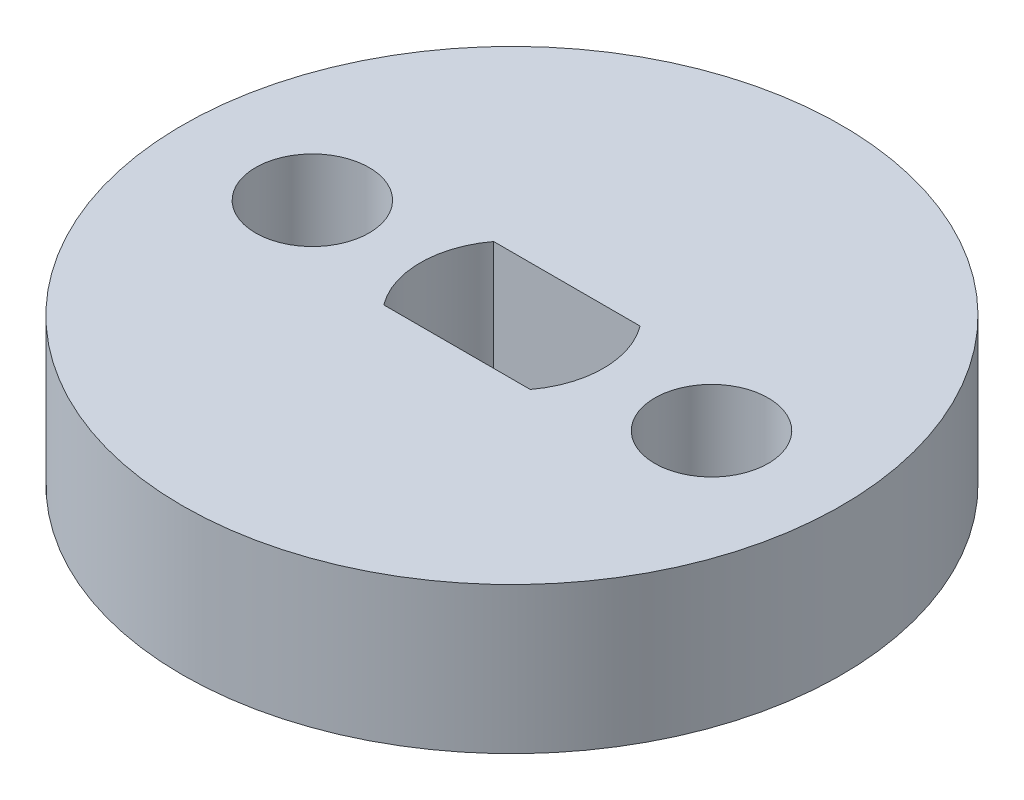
ISO-10303-21;
HEADER;
FILE_DESCRIPTION(('STEP AP214'),'2;1');
FILE_NAME('part.step','',(''),(''),'','','');
FILE_SCHEMA(('AUTOMOTIVE_DESIGN { 1 0 10303 214 1 1 1 1 }'));
ENDSEC;
DATA;
#1=APPLICATION_CONTEXT('core data for automotive mechanical design processes');
#2=APPLICATION_PROTOCOL_DEFINITION('international standard','automotive_design',2000,#1);
#3=PRODUCT_CONTEXT('',#1,'mechanical');
#4=PRODUCT('Part','Part','',(#3));
#5=PRODUCT_RELATED_PRODUCT_CATEGORY('part','',(#4));
#6=PRODUCT_DEFINITION_FORMATION('','',#4);
#7=PRODUCT_DEFINITION_CONTEXT('part definition',#1,'design');
#8=PRODUCT_DEFINITION('design','',#6,#7);
#9=PRODUCT_DEFINITION_SHAPE('','',#8);
#10=(LENGTH_UNIT() NAMED_UNIT(*) SI_UNIT(.MILLI.,.METRE.));
#11=(NAMED_UNIT(*) PLANE_ANGLE_UNIT() SI_UNIT($,.RADIAN.));
#12=(NAMED_UNIT(*) SI_UNIT($,.STERADIAN.) SOLID_ANGLE_UNIT());
#13=UNCERTAINTY_MEASURE_WITH_UNIT(LENGTH_MEASURE(1.E-05),#10,'distance_accuracy_value','');
#14=(GEOMETRIC_REPRESENTATION_CONTEXT(3) GLOBAL_UNCERTAINTY_ASSIGNED_CONTEXT((#13)) GLOBAL_UNIT_ASSIGNED_CONTEXT((#10,
#11,#12)) REPRESENTATION_CONTEXT('',''));
#15=CARTESIAN_POINT('',(0.,0.,0.));
#16=DIRECTION('',(0.,0.,1.));
#17=DIRECTION('',(1.,0.,0.));
#18=AXIS2_PLACEMENT_3D('',#15,#16,#17);
#19=CARTESIAN_POINT('',(0.,-4.,0.));
#20=DIRECTION('',(0.,1.,0.));
#21=DIRECTION('',(0.,0.,1.));
#22=AXIS2_PLACEMENT_3D('',#19,#20,#21);
#23=CYLINDRICAL_SURFACE('',#22,9.);
#24=CARTESIAN_POINT('',(0.,-4.,0.));
#25=DIRECTION('',(0.,1.,0.));
#26=DIRECTION('',(0.,0.,1.));
#27=AXIS2_PLACEMENT_3D('',#24,#25,#26);
#28=CIRCLE('',#27,9.);
#29=CARTESIAN_POINT('',(0.,-4.,9.));
#30=VERTEX_POINT('',#29);
#31=EDGE_CURVE('E11',#30,#30,#28,.T.);
#32=ORIENTED_EDGE('',*,*,#31,.T.);
#33=EDGE_LOOP('',(#32));
#34=FACE_BOUND('',#33,.T.);
#35=CARTESIAN_POINT('',(0.,0.,0.));
#36=DIRECTION('',(0.,1.,0.));
#37=DIRECTION('',(0.,0.,1.));
#38=AXIS2_PLACEMENT_3D('',#35,#36,#37);
#39=CIRCLE('',#38,9.);
#40=CARTESIAN_POINT('',(0.,0.,9.));
#41=VERTEX_POINT('',#40);
#42=EDGE_CURVE('E41',#41,#41,#39,.T.);
#43=ORIENTED_EDGE('',*,*,#42,.F.);
#44=EDGE_LOOP('',(#43));
#45=FACE_BOUND('',#44,.T.);
#46=ADVANCED_FACE('F38',(#34,#45),#23,.T.);
#47=CARTESIAN_POINT('',(0.,-4.,0.));
#48=DIRECTION('',(0.,1.,0.));
#49=DIRECTION('',(0.,0.,1.));
#50=AXIS2_PLACEMENT_3D('',#47,#48,#49);
#51=PLANE('',#50);
#52=CARTESIAN_POINT('',(-5.45,-4.,0.));
#53=DIRECTION('',(0.,1.,0.));
#54=DIRECTION('',(0.,0.,1.));
#55=AXIS2_PLACEMENT_3D('',#52,#53,#54);
#56=CIRCLE('',#55,1.55);
#57=CARTESIAN_POINT('',(-5.45,-4.,1.55));
#58=VERTEX_POINT('',#57);
#59=EDGE_CURVE('E160',#58,#58,#56,.T.);
#60=ORIENTED_EDGE('',*,*,#59,.T.);
#61=EDGE_LOOP('',(#60));
#62=FACE_BOUND('',#61,.T.);
#63=CARTESIAN_POINT('',(5.45,-4.,0.));
#64=DIRECTION('',(0.,1.,0.));
#65=DIRECTION('',(0.,0.,1.));
#66=AXIS2_PLACEMENT_3D('',#63,#64,#65);
#67=CIRCLE('',#66,1.55);
#68=CARTESIAN_POINT('',(5.45,-4.,1.55));
#69=VERTEX_POINT('',#68);
#70=EDGE_CURVE('E161',#69,#69,#67,.T.);
#71=ORIENTED_EDGE('',*,*,#70,.T.);
#72=EDGE_LOOP('',(#71));
#73=FACE_BOUND('',#72,.T.);
#74=DIRECTION('',(1.,0.,0.));
#75=VECTOR('',#74,1.);
#76=CARTESIAN_POINT('',(0.,-4.,1.5));
#77=LINE('',#76,#75);
#78=CARTESIAN_POINT('',(-2.,-4.,1.5));
#79=VERTEX_POINT('',#78);
#80=CARTESIAN_POINT('',(2.,-4.,1.5));
#81=VERTEX_POINT('',#80);
#82=EDGE_CURVE('E109',#79,#81,#77,.T.);
#83=ORIENTED_EDGE('',*,*,#82,.T.);
#84=CARTESIAN_POINT('',(0.,-4.,0.));
#85=DIRECTION('',(0.,1.,0.));
#86=DIRECTION('',(0.,0.,1.));
#87=AXIS2_PLACEMENT_3D('',#84,#85,#86);
#88=CIRCLE('',#87,2.5);
#89=CARTESIAN_POINT('',(2.,-4.,-1.5));
#90=VERTEX_POINT('',#89);
#91=EDGE_CURVE('E112',#81,#90,#88,.T.);
#92=ORIENTED_EDGE('',*,*,#91,.T.);
#93=DIRECTION('',(-1.,0.,0.));
#94=VECTOR('',#93,1.);
#95=CARTESIAN_POINT('',(0.,-4.,-1.5));
#96=LINE('',#95,#94);
#97=CARTESIAN_POINT('',(-2.,-4.,-1.5));
#98=VERTEX_POINT('',#97);
#99=EDGE_CURVE('E104',#90,#98,#96,.T.);
#100=ORIENTED_EDGE('',*,*,#99,.T.);
#101=CARTESIAN_POINT('',(0.,-4.,0.));
#102=DIRECTION('',(0.,1.,0.));
#103=DIRECTION('',(0.,0.,1.));
#104=AXIS2_PLACEMENT_3D('',#101,#102,#103);
#105=CIRCLE('',#104,2.5);
#106=EDGE_CURVE('E84',#98,#79,#105,.T.);
#107=ORIENTED_EDGE('',*,*,#106,.T.);
#108=EDGE_LOOP('',(#83,#92,#100,#107));
#109=FACE_BOUND('',#108,.T.);
#110=ORIENTED_EDGE('',*,*,#31,.F.);
#111=EDGE_LOOP('',(#110));
#112=FACE_BOUND('',#111,.T.);
#113=ADVANCED_FACE('F119',(#62,#73,#109,#112),#51,.F.);
#114=CARTESIAN_POINT('',(0.,0.,0.));
#115=DIRECTION('',(0.,1.,0.));
#116=DIRECTION('',(0.,0.,1.));
#117=AXIS2_PLACEMENT_3D('',#114,#115,#116);
#118=PLANE('',#117);
#119=CARTESIAN_POINT('',(-5.45,0.,0.));
#120=DIRECTION('',(0.,1.,0.));
#121=DIRECTION('',(0.,0.,1.));
#122=AXIS2_PLACEMENT_3D('',#119,#120,#121);
#123=CIRCLE('',#122,1.55);
#124=CARTESIAN_POINT('',(-5.45,0.,1.55));
#125=VERTEX_POINT('',#124);
#126=EDGE_CURVE('E158',#125,#125,#123,.T.);
#127=ORIENTED_EDGE('',*,*,#126,.F.);
#128=EDGE_LOOP('',(#127));
#129=FACE_BOUND('',#128,.T.);
#130=CARTESIAN_POINT('',(5.45,0.,0.));
#131=DIRECTION('',(0.,1.,0.));
#132=DIRECTION('',(0.,0.,1.));
#133=AXIS2_PLACEMENT_3D('',#130,#131,#132);
#134=CIRCLE('',#133,1.55);
#135=CARTESIAN_POINT('',(5.45,0.,1.55));
#136=VERTEX_POINT('',#135);
#137=EDGE_CURVE('E166',#136,#136,#134,.T.);
#138=ORIENTED_EDGE('',*,*,#137,.F.);
#139=EDGE_LOOP('',(#138));
#140=FACE_BOUND('',#139,.T.);
#141=CARTESIAN_POINT('',(0.,0.,0.));
#142=DIRECTION('',(0.,1.,0.));
#143=DIRECTION('',(0.,0.,1.));
#144=AXIS2_PLACEMENT_3D('',#141,#142,#143);
#145=CIRCLE('',#144,2.5);
#146=CARTESIAN_POINT('',(2.,0.,1.5));
#147=VERTEX_POINT('',#146);
#148=CARTESIAN_POINT('',(2.,0.,-1.5));
#149=VERTEX_POINT('',#148);
#150=EDGE_CURVE('E60',#147,#149,#145,.T.);
#151=ORIENTED_EDGE('',*,*,#150,.F.);
#152=DIRECTION('',(1.,0.,0.));
#153=VECTOR('',#152,1.);
#154=CARTESIAN_POINT('',(0.,0.,1.5));
#155=LINE('',#154,#153);
#156=CARTESIAN_POINT('',(-2.,0.,1.5));
#157=VERTEX_POINT('',#156);
#158=EDGE_CURVE('E97',#157,#147,#155,.T.);
#159=ORIENTED_EDGE('',*,*,#158,.F.);
#160=CARTESIAN_POINT('',(0.,0.,0.));
#161=DIRECTION('',(0.,1.,0.));
#162=DIRECTION('',(0.,0.,1.));
#163=AXIS2_PLACEMENT_3D('',#160,#161,#162);
#164=CIRCLE('',#163,2.5);
#165=CARTESIAN_POINT('',(-2.,0.,-1.5));
#166=VERTEX_POINT('',#165);
#167=EDGE_CURVE('E81',#166,#157,#164,.T.);
#168=ORIENTED_EDGE('',*,*,#167,.F.);
#169=DIRECTION('',(-1.,0.,0.));
#170=VECTOR('',#169,1.);
#171=CARTESIAN_POINT('',(-2.,0.,-1.5));
#172=LINE('',#171,#170);
#173=EDGE_CURVE('E90',#149,#166,#172,.T.);
#174=ORIENTED_EDGE('',*,*,#173,.F.);
#175=EDGE_LOOP('',(#151,#159,#168,#174));
#176=FACE_BOUND('',#175,.T.);
#177=ORIENTED_EDGE('',*,*,#42,.T.);
#178=EDGE_LOOP('',(#177));
#179=FACE_BOUND('',#178,.T.);
#180=ADVANCED_FACE('F94',(#129,#140,#176,#179),#118,.T.);
#181=CARTESIAN_POINT('',(0.,-10.,0.));
#182=DIRECTION('',(0.,1.,0.));
#183=DIRECTION('',(0.,0.,1.));
#184=AXIS2_PLACEMENT_3D('',#181,#182,#183);
#185=CYLINDRICAL_SURFACE('',#184,2.5);
#186=DIRECTION('',(0.,1.,0.));
#187=VECTOR('',#186,1.);
#188=CARTESIAN_POINT('',(2.,-10.,1.5));
#189=LINE('',#188,#187);
#190=EDGE_CURVE('E102',#81,#147,#189,.T.);
#191=ORIENTED_EDGE('',*,*,#190,.T.);
#192=ORIENTED_EDGE('',*,*,#150,.T.);
#193=DIRECTION('',(0.,1.,0.));
#194=VECTOR('',#193,1.);
#195=CARTESIAN_POINT('',(2.,-10.,-1.5));
#196=LINE('',#195,#194);
#197=EDGE_CURVE('E87',#90,#149,#196,.T.);
#198=ORIENTED_EDGE('',*,*,#197,.F.);
#199=ORIENTED_EDGE('',*,*,#91,.F.);
#200=EDGE_LOOP('',(#191,#192,#198,#199));
#201=FACE_BOUND('',#200,.T.);
#202=ADVANCED_FACE('F131',(#201),#185,.F.);
#203=CARTESIAN_POINT('',(0.,-10.,1.5));
#204=DIRECTION('',(0.,0.,1.));
#205=DIRECTION('',(1.,0.,0.));
#206=AXIS2_PLACEMENT_3D('',#203,#204,#205);
#207=PLANE('',#206);
#208=DIRECTION('',(0.,1.,0.));
#209=VECTOR('',#208,1.);
#210=CARTESIAN_POINT('',(-2.,-10.,1.5));
#211=LINE('',#210,#209);
#212=EDGE_CURVE('E86',#79,#157,#211,.T.);
#213=ORIENTED_EDGE('',*,*,#212,.T.);
#214=ORIENTED_EDGE('',*,*,#158,.T.);
#215=ORIENTED_EDGE('',*,*,#190,.F.);
#216=ORIENTED_EDGE('',*,*,#82,.F.);
#217=EDGE_LOOP('',(#213,#214,#215,#216));
#218=FACE_BOUND('',#217,.T.);
#219=ADVANCED_FACE('F138',(#218),#207,.F.);
#220=CARTESIAN_POINT('',(0.,-10.,0.));
#221=DIRECTION('',(0.,1.,0.));
#222=DIRECTION('',(0.,0.,1.));
#223=AXIS2_PLACEMENT_3D('',#220,#221,#222);
#224=CYLINDRICAL_SURFACE('',#223,2.5);
#225=DIRECTION('',(0.,1.,0.));
#226=VECTOR('',#225,1.);
#227=CARTESIAN_POINT('',(-2.,-10.,-1.5));
#228=LINE('',#227,#226);
#229=EDGE_CURVE('E52',#98,#166,#228,.T.);
#230=ORIENTED_EDGE('',*,*,#229,.T.);
#231=ORIENTED_EDGE('',*,*,#167,.T.);
#232=ORIENTED_EDGE('',*,*,#212,.F.);
#233=ORIENTED_EDGE('',*,*,#106,.F.);
#234=EDGE_LOOP('',(#230,#231,#232,#233));
#235=FACE_BOUND('',#234,.T.);
#236=ADVANCED_FACE('F78',(#235),#224,.F.);
#237=CARTESIAN_POINT('',(-2.,-10.,-1.5));
#238=DIRECTION('',(0.,0.,-1.));
#239=DIRECTION('',(-1.,0.,0.));
#240=AXIS2_PLACEMENT_3D('',#237,#238,#239);
#241=PLANE('',#240);
#242=ORIENTED_EDGE('',*,*,#197,.T.);
#243=ORIENTED_EDGE('',*,*,#173,.T.);
#244=ORIENTED_EDGE('',*,*,#229,.F.);
#245=ORIENTED_EDGE('',*,*,#99,.F.);
#246=EDGE_LOOP('',(#242,#243,#244,#245));
#247=FACE_BOUND('',#246,.T.);
#248=ADVANCED_FACE('F91',(#247),#241,.F.);
#249=CARTESIAN_POINT('',(5.45,-10.,0.));
#250=DIRECTION('',(0.,1.,0.));
#251=DIRECTION('',(0.,0.,1.));
#252=AXIS2_PLACEMENT_3D('',#249,#250,#251);
#253=CYLINDRICAL_SURFACE('',#252,1.55);
#254=ORIENTED_EDGE('',*,*,#137,.T.);
#255=EDGE_LOOP('',(#254));
#256=FACE_BOUND('',#255,.T.);
#257=ORIENTED_EDGE('',*,*,#70,.F.);
#258=EDGE_LOOP('',(#257));
#259=FACE_BOUND('',#258,.T.);
#260=ADVANCED_FACE('F141',(#256,#259),#253,.F.);
#261=CARTESIAN_POINT('',(-5.45,-10.,0.));
#262=DIRECTION('',(0.,1.,0.));
#263=DIRECTION('',(0.,0.,1.));
#264=AXIS2_PLACEMENT_3D('',#261,#262,#263);
#265=CYLINDRICAL_SURFACE('',#264,1.55);
#266=ORIENTED_EDGE('',*,*,#126,.T.);
#267=EDGE_LOOP('',(#266));
#268=FACE_BOUND('',#267,.T.);
#269=ORIENTED_EDGE('',*,*,#59,.F.);
#270=EDGE_LOOP('',(#269));
#271=FACE_BOUND('',#270,.T.);
#272=ADVANCED_FACE('F149',(#268,#271),#265,.F.);
#273=CLOSED_SHELL('',(#46,#113,#180,#202,#219,#236,#248,#260,#272));
#274=MANIFOLD_SOLID_BREP('B2',#273);
#275=ADVANCED_BREP_SHAPE_REPRESENTATION('',(#18,#274),#14);
#276=SHAPE_DEFINITION_REPRESENTATION(#9,#275);
ENDSEC;
END-ISO-10303-21;
